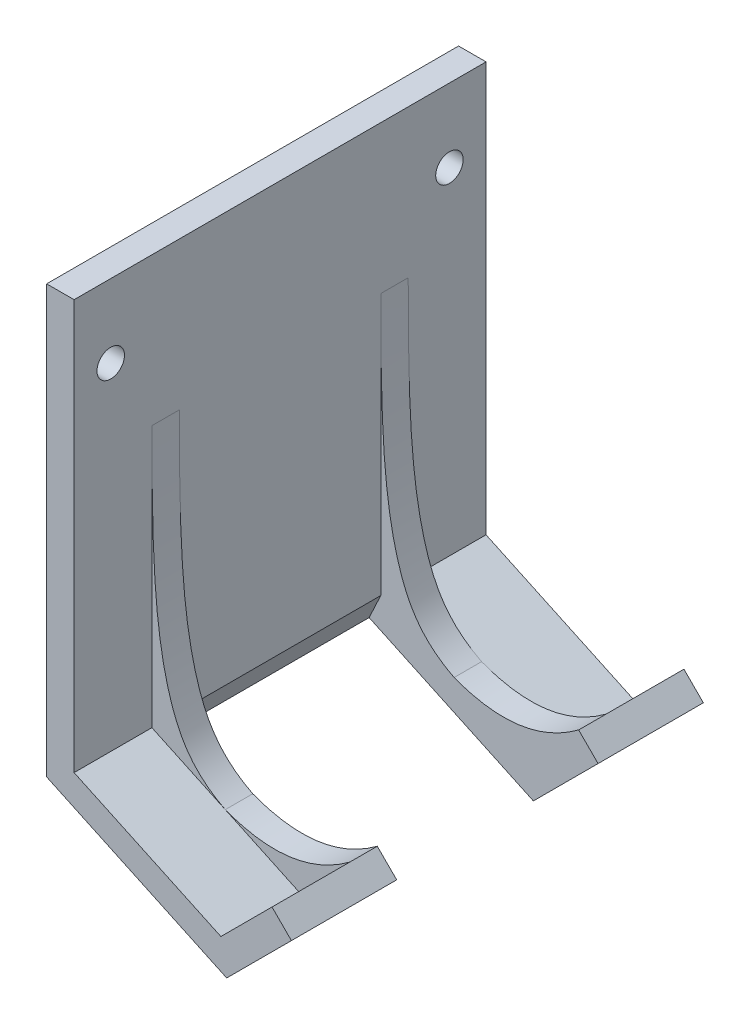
from build123d import *

# Parameters (mm, degrees)
EXTRUDE_1_DEPTH          = 45
SKETCH_2_R               = 1.5
CUT_EXTRUDE_1_DEPTH      = 50
CUT_EXTRUDE_2_DEPTH      = 50
CUT_EXTRUDE_2_DEPTH_BACK = 50
SKETCH_3_W               = 23.213208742
SKETCH_3_H               = 22
EXTRUDE_START            = -11.5
EXTRUDE_2_DEPTH          = 3
EXTRUDE_3_DEPTH          = 3
SKETCH_7_R               = 1.5
CUT_EXTRUDE_3_DEPTH      = 3


with BuildPart() as part:
    # Sketch 1 → Extrude 1 (new body)
    with BuildSketch(Plane.XY):
        Polygon((0, 0), (-19.669124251, 9.186544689), (-19.669124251, 55.838489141), (-16.669124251, 55.838489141), (-16.669124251, 11.096463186), (-0.634986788, 3.607653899), (4.949747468, 9.192388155), (7.071067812, 7.071067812), align=None)
    extrude(amount=EXTRUDE_1_DEPTH)

    # Sketch 2 → Cut-Extrude 1 (cut)
    with BuildSketch(Plane(origin=(-2.121320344, 2.121320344, 0), x_dir=(0, 0, 1), z_dir=(-0.707106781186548, 0.7071067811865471, 0))):
        with Locations(Location((2.5, 6.050996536, 0), (0, 0, 270))):
            Circle(SKETCH_2_R)
        with Locations(Location((42.5, 6.050996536, 0), (0, 0, 270))):
            Circle(SKETCH_2_R)
    extrude(amount=-CUT_EXTRUDE_1_DEPTH, mode=Mode.SUBTRACT)

    # Sketch 3 → Cut-Extrude 2 (cut, two sides: drawn at the far end of the back side and taken through both)
    with BuildSketch(Plane(origin=(1.269521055, 2.718145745, 0), x_dir=(0.9060485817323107, -0.4231736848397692, 0), z_dir=(0.4231736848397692, 0.9060485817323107, 0)).offset(-CUT_EXTRUDE_2_DEPTH_BACK)):
        with Locations((-8.19216323, -22.5)):
            Rectangle(SKETCH_3_W, SKETCH_3_H)
    extrude(amount=CUT_EXTRUDE_2_DEPTH + CUT_EXTRUDE_2_DEPTH_BACK, mode=Mode.SUBTRACT)

    # Sketch 4 → Extrude 2 (add)
    with BuildSketch(Plane.XY.offset(45).offset(EXTRUDE_START)):
        with BuildLine():
            add(Edge.make_bspline(
                [(4.949747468, 9.192388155), (-1.303226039, 4.551867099), (-8.652055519, 7.352058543)],
                knots=[0, 0, 0, 1, 1, 1], degree=2))
            Line((-8.652055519, 7.352058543), (-0.634986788, 3.607653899))
            Line((-0.634986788, 3.607653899), (4.949747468, 9.192388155))
        make_face()
        with BuildLine():
            add(Edge.make_bspline(
                [(-8.652055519, 7.352058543), (-12.195272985, 9.153020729), (-16.396250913, 16.451731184), (-16.656847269, 28.631190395), (-16.669124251, 39.669474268)],
                knots=[0, 0, 0, 0, 0.319198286, 0.90776647, 0.90776647, 0.90776647, 0.90776647], degree=3))
            Line((-16.669124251, 39.669474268), (-16.669124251, 11.096463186))
            Line((-16.669124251, 11.096463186), (-8.652055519, 7.352058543))
        make_face()
    extrude(amount=EXTRUDE_2_DEPTH)

    # Sketch 6 → Extrude 3 (add)
    with BuildSketch(Plane(origin=(0, 0, 0), x_dir=(-1, 0, 0), z_dir=(0, 0, -1)).offset(EXTRUDE_START)):
        with BuildLine():
            add(Edge.make_bspline(
                [(8.652055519, 7.352058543), (12.19527387, 9.153021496), (16.396252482, 16.451734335), (16.656848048, 28.631197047), (16.669124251, 39.669484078)],
                knots=[0, 0, 0, 0, 0.319198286, 0.90776647, 0.90776647, 0.90776647, 0.90776647], degree=3))
            Line((8.652055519, 7.352058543), (16.669124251, 11.096463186))
            Line((16.669124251, 11.096463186), (16.669124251, 39.669484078))
        make_face()
        with BuildLine():
            add(Edge.make_bspline(
                [(-4.949747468, 9.192388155), (1.303226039, 4.551867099), (8.652055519, 7.352058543)],
                knots=[0, 0, 0, 1, 1, 1], degree=2))
            Line((-4.949747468, 9.192388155), (0.634986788, 3.607653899))
            Line((0.634986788, 3.607653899), (8.652055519, 7.352058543))
        make_face()
    extrude(amount=EXTRUDE_3_DEPTH)

    # Sketch 7 → Cut-Extrude 3 (cut)
    with BuildSketch(Plane(origin=(-16.669124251, 0, 0), x_dir=(0, 0, -1), z_dir=(1, 0, 0))):
        with Locations((-41, 47.838489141)):
            Circle(SKETCH_7_R)
        with Locations(Location((-4, 47.838489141, 0), (0, 0, 180))):
            Circle(SKETCH_7_R)
    extrude(amount=-CUT_EXTRUDE_3_DEPTH, mode=Mode.SUBTRACT)


solid = part.part
